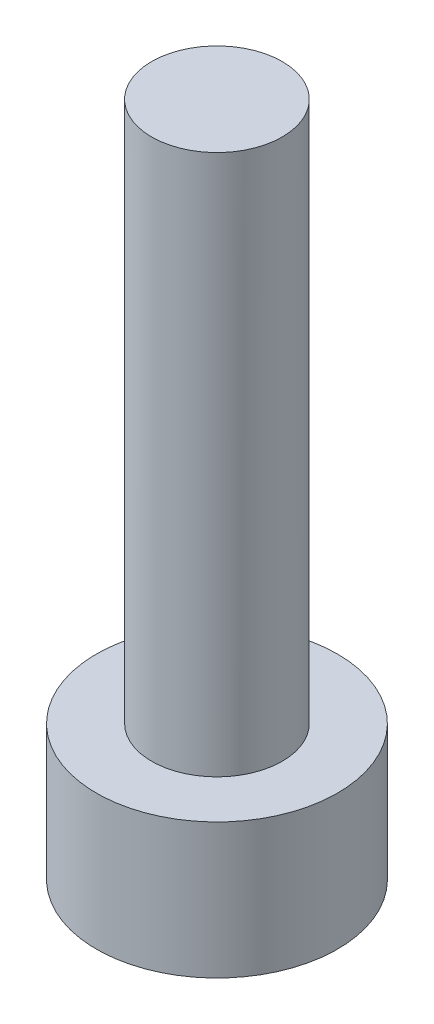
from build123d import *

# Parameters (mm, degrees)
SKETCH1_R           = 1.45
BOSS_EXTRUDE1_DEPTH = 12
SKETCH2_R           = 2.675
BOSS_EXTRUDE2_DEPTH = 3
CUT_EXTRUDE1_DEPTH  = 2


with BuildPart() as part:
    # Sketch1 → Boss-Extrude1 (new body)
    with BuildSketch(Plane(origin=(0, 0, 0), x_dir=(1, 0, 0), z_dir=(0, 1, 0))):
        with Locations(Location((0, 0, 0), (0, 0, 270))):
            Circle(SKETCH1_R)
    extrude(amount=BOSS_EXTRUDE1_DEPTH)

    # Sketch2 → Boss-Extrude2 (add)
    with BuildSketch(Plane.XZ):
        with Locations(Location((0, 0, 0), (0, 0, 270))):
            Circle(SKETCH2_R)
    extrude(amount=BOSS_EXTRUDE2_DEPTH)

    # Sketch3 → Cut-Extrude1 (cut)
    with BuildSketch(Plane.XZ.offset(3)):
        Polygon((1.661945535, 0.487787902), (0.408536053, 1.683181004), (-1.253409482, 1.195393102), (-1.661945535, -0.487787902), (-0.408536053, -1.683181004), (1.253409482, -1.195393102), align=None)
    extrude(amount=-CUT_EXTRUDE1_DEPTH, mode=Mode.SUBTRACT)


solid = part.part
